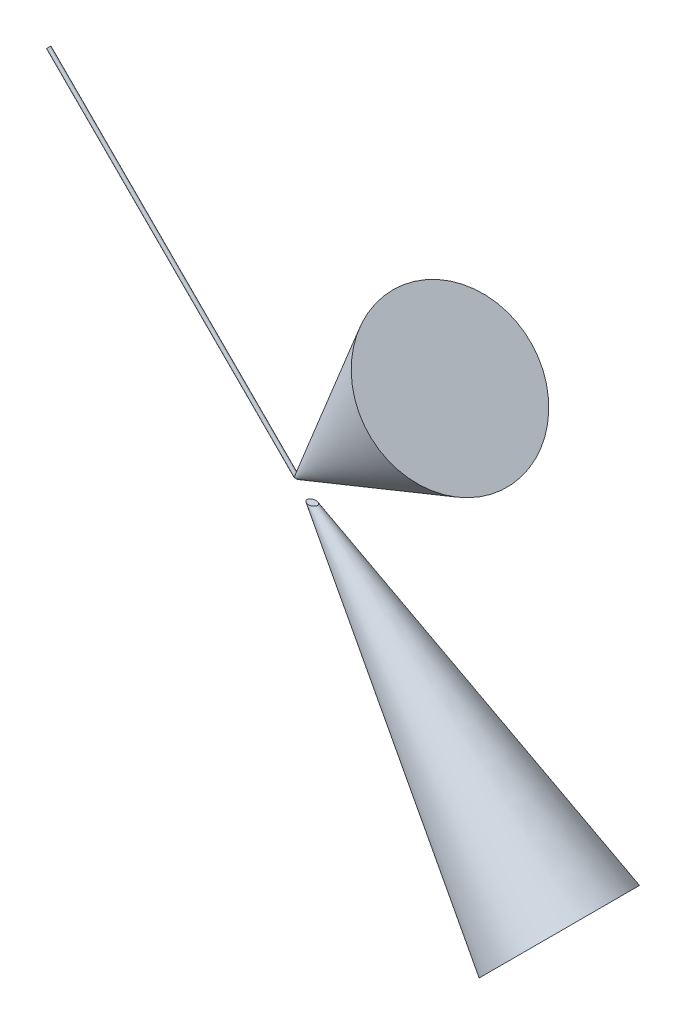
ISO-10303-21;
HEADER;
FILE_DESCRIPTION(('STEP AP214'),'2;1');
FILE_NAME('part.step','',(''),(''),'','','');
FILE_SCHEMA(('AUTOMOTIVE_DESIGN { 1 0 10303 214 1 1 1 1 }'));
ENDSEC;
DATA;
#1=APPLICATION_CONTEXT('core data for automotive mechanical design processes');
#2=APPLICATION_PROTOCOL_DEFINITION('international standard','automotive_design',2000,#1);
#3=PRODUCT_CONTEXT('',#1,'mechanical');
#4=PRODUCT('Part','Part','',(#3));
#5=PRODUCT_RELATED_PRODUCT_CATEGORY('part','',(#4));
#6=PRODUCT_DEFINITION_FORMATION('','',#4);
#7=PRODUCT_DEFINITION_CONTEXT('part definition',#1,'design');
#8=PRODUCT_DEFINITION('design','',#6,#7);
#9=PRODUCT_DEFINITION_SHAPE('','',#8);
#10=(LENGTH_UNIT() NAMED_UNIT(*) SI_UNIT(.MILLI.,.METRE.));
#11=(NAMED_UNIT(*) PLANE_ANGLE_UNIT() SI_UNIT($,.RADIAN.));
#12=(NAMED_UNIT(*) SI_UNIT($,.STERADIAN.) SOLID_ANGLE_UNIT());
#13=UNCERTAINTY_MEASURE_WITH_UNIT(LENGTH_MEASURE(1.E-05),#10,'distance_accuracy_value','');
#14=(GEOMETRIC_REPRESENTATION_CONTEXT(3) GLOBAL_UNCERTAINTY_ASSIGNED_CONTEXT((#13)) GLOBAL_UNIT_ASSIGNED_CONTEXT((#10,
#11,#12)) REPRESENTATION_CONTEXT('',''));
#15=CARTESIAN_POINT('',(0.,0.,0.));
#16=DIRECTION('',(0.,0.,1.));
#17=DIRECTION('',(1.,0.,0.));
#18=AXIS2_PLACEMENT_3D('',#15,#16,#17);
#19=CARTESIAN_POINT('',(-55.558556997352,55.5585569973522,0.));
#20=DIRECTION('',(-0.707106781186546,0.707106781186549,0.));
#21=DIRECTION('',(-0.707106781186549,-0.707106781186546,0.));
#22=AXIS2_PLACEMENT_3D('',#19,#20,#21);
#23=CYLINDRICAL_SURFACE('',#22,0.25);
#24=CARTESIAN_POINT('',(-35.3553390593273,35.3553390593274,0.));
#25=DIRECTION('',(-0.707106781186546,0.707106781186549,0.));
#26=DIRECTION('',(-0.707106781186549,-0.707106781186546,0.));
#27=AXIS2_PLACEMENT_3D('',#24,#25,#26);
#28=CIRCLE('',#27,0.25);
#29=CARTESIAN_POINT('',(-35.532115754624,35.1785623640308,0.));
#30=VERTEX_POINT('',#29);
#31=EDGE_CURVE('E46',#30,#30,#28,.T.);
#32=ORIENTED_EDGE('',*,*,#31,.F.);
#33=EDGE_LOOP('',(#32));
#34=FACE_BOUND('',#33,.T.);
#35=CARTESIAN_POINT('',(-0.999799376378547,0.999800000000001,-0.249999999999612));
#36=CARTESIAN_POINT('',(-1.00470901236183,1.00461675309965,-0.249992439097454));
#37=CARTESIAN_POINT('',(-1.00894423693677,1.00998662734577,-0.250001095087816));
#38=CARTESIAN_POINT('',(-1.01624272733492,1.02131728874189,-0.249980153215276));
#39=CARTESIAN_POINT('',(-1.01932991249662,1.0272623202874,-0.249951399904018));
#40=CARTESIAN_POINT('',(-1.02804242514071,1.04706337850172,-0.249691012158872));
#41=CARTESIAN_POINT('',(-1.03205564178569,1.06157119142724,-0.249251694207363));
#42=CARTESIAN_POINT('',(-1.0385569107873,1.09106946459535,-0.247372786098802));
#43=CARTESIAN_POINT('',(-1.04101149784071,1.10606368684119,-0.245912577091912));
#44=CARTESIAN_POINT('',(-1.04686474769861,1.14812805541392,-0.240116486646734));
#45=CARTESIAN_POINT('',(-1.04941995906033,1.17515125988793,-0.234409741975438));
#46=CARTESIAN_POINT('',(-1.05370587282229,1.22768941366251,-0.218453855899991));
#47=CARTESIAN_POINT('',(-1.05544333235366,1.25321514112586,-0.208243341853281));
#48=CARTESIAN_POINT('',(-1.0578000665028,1.29135435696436,-0.188058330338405));
#49=CARTESIAN_POINT('',(-1.05858172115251,1.30486909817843,-0.179804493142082));
#50=CARTESIAN_POINT('',(-1.0600090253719,1.33058367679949,-0.161409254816));
#51=CARTESIAN_POINT('',(-1.06065472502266,1.34278399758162,-0.151268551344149));
#52=CARTESIAN_POINT('',(-1.06168606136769,1.36284685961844,-0.131387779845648));
#53=CARTESIAN_POINT('',(-1.0620977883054,1.37107935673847,-0.122024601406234));
#54=CARTESIAN_POINT('',(-1.06282873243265,1.38594011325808,-0.102094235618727));
#55=CARTESIAN_POINT('',(-1.06314808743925,1.39257076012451,-0.0915288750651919));
#56=CARTESIAN_POINT('',(-1.06363197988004,1.40272397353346,-0.0714091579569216));
#57=CARTESIAN_POINT('',(-1.06381426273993,1.40659520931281,-0.062032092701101));
#58=CARTESIAN_POINT('',(-1.06410136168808,1.41272252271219,-0.0427608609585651));
#59=CARTESIAN_POINT('',(-1.06420623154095,1.41497972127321,-0.0328670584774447));
#60=CARTESIAN_POINT('',(-1.06433304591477,1.41771194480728,-0.0127915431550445));
#61=CARTESIAN_POINT('',(-1.06435465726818,1.41817980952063,-0.00260883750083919));
#62=CARTESIAN_POINT('',(-1.06431266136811,1.41727326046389,0.0176737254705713));
#63=CARTESIAN_POINT('',(-1.06424904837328,1.41589872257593,0.0277735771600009));
#64=CARTESIAN_POINT('',(-1.06404683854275,1.41155847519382,0.0469731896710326));
#65=CARTESIAN_POINT('',(-1.06391302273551,1.40869431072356,0.0560964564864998));
#66=CARTESIAN_POINT('',(-1.0635796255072,1.40162540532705,0.0738019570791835));
#67=CARTESIAN_POINT('',(-1.06338001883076,1.3974201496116,0.0823839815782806));
#68=CARTESIAN_POINT('',(-1.06283079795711,1.38599355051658,0.102154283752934));
#69=CARTESIAN_POINT('',(-1.06245307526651,1.37823701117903,0.113032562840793));
#70=CARTESIAN_POINT('',(-1.06159582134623,1.36107487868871,0.133393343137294));
#71=CARTESIAN_POINT('',(-1.06111608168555,1.35166591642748,0.142872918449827));
#72=CARTESIAN_POINT('',(-1.05984433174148,1.32751514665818,0.164072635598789));
#73=CARTESIAN_POINT('',(-1.05900512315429,1.31217402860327,0.175105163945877));
#74=CARTESIAN_POINT('',(-1.05711624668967,1.27997012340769,0.194626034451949));
#75=CARTESIAN_POINT('',(-1.0560661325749,1.26310415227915,0.203108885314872));
#76=CARTESIAN_POINT('',(-1.05320969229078,1.22124098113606,0.220791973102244));
#77=CARTESIAN_POINT('',(-1.05127017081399,1.19576257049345,0.228841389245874));
#78=CARTESIAN_POINT('',(-1.04748193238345,1.15698628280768,0.237869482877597));
#79=CARTESIAN_POINT('',(-1.04607202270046,1.14396291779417,0.240371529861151));
#80=CARTESIAN_POINT('',(-1.04274165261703,1.11783685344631,0.244435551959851));
#81=CARTESIAN_POINT('',(-1.04082168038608,1.10473424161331,0.245998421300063));
#82=CARTESIAN_POINT('',(-1.03671555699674,1.0825069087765,0.247952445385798));
#83=CARTESIAN_POINT('',(-1.03477707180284,1.0733545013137,0.248553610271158));
#84=CARTESIAN_POINT('',(-1.03006566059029,1.05524077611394,0.249410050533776));
#85=CARTESIAN_POINT('',(-1.02729389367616,1.04627921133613,0.249665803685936));
#86=CARTESIAN_POINT('',(-1.02145155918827,1.03179285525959,0.249905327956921));
#87=CARTESIAN_POINT('',(-1.01878375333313,1.02611254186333,0.249951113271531));
#88=CARTESIAN_POINT('',(-1.01255301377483,1.01527743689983,0.24999834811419));
#89=CARTESIAN_POINT('',(-1.00899481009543,1.01012006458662,0.250000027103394));
#90=CARTESIAN_POINT('',(-1.00331965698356,1.00344477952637,0.249999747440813));
#91=CARTESIAN_POINT('',(-1.00159972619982,1.00158264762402,0.249999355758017));
#92=CARTESIAN_POINT('',(-0.999799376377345,0.999800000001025,0.250000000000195));
#93=B_SPLINE_CURVE_WITH_KNOTS('',3,(#35,#36,#37,#38,#39,#40,#41,#42,#43,#44,#45,#46,#47,#48,#49,
#50,#51,#52,#53,#54,#55,#56,#57,#58,#59,#60,#61,#62,#63,#64,#65,#66,#67,#68,#69,#70,#71,#72,#73,
#74,#75,#76,#77,#78,#79,#80,#81,#82,#83,#84,#85,#86,#87,#88,#89,#90,#91,#92),.UNSPECIFIED.,.F.,
.F.,(4,2,2,2,2,2,2,2,2,2,2,2,2,2,2,2,2,2,2,2,2,2,2,2,2,2,2,2,4),(0.,0.0204460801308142,
0.040438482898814,0.0852704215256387,0.131035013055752,0.213834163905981,0.295936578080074,
0.343372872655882,0.390791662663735,0.428084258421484,0.465320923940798,0.495633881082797,
0.525925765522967,0.556338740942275,0.58675376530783,0.615324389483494,0.643905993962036,
0.683780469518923,0.723737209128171,0.780167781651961,0.836719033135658,0.916627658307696,
0.956610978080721,0.996556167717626,1.02465889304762,1.05272270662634,1.07149501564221,
1.09016964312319,1.09776723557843),.UNSPECIFIED.);
#94=CARTESIAN_POINT('',(-0.999999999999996,0.999999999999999,-0.25));
#95=VERTEX_POINT('',#94);
#96=CARTESIAN_POINT('',(-0.999999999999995,1.,0.25));
#97=VERTEX_POINT('',#96);
#98=EDGE_CURVE('E61',#95,#97,#93,.T.);
#99=ORIENTED_EDGE('',*,*,#98,.F.);
#100=CARTESIAN_POINT('',(-0.999999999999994,1.,0.));
#101=DIRECTION('',(0.,1.,0.));
#102=DIRECTION('',(-1.,0.,0.));
#103=AXIS2_PLACEMENT_3D('',#100,#101,#102);
#104=ELLIPSE('',#103,0.353553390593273,0.25);
#105=EDGE_CURVE('E12',#95,#97,#104,.T.);
#106=ORIENTED_EDGE('',*,*,#105,.T.);
#107=EDGE_LOOP('',(#99,#106));
#108=FACE_BOUND('',#107,.T.);
#109=ADVANCED_FACE('F42',(#34,#108),#23,.T.);
#110=CARTESIAN_POINT('',(-5.89657788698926,1.,-5.));
#111=DIRECTION('',(0.,1.,0.));
#112=DIRECTION('',(0.,0.,1.));
#113=AXIS2_PLACEMENT_3D('',#110,#111,#112);
#114=PLANE('',#113);
#115=ORIENTED_EDGE('',*,*,#105,.F.);
#116=CARTESIAN_POINT('',(-0.851666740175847,1.,0.));
#117=DIRECTION('',(0.,1.,0.));
#118=DIRECTION('',(1.,0.,0.));
#119=AXIS2_PLACEMENT_3D('',#116,#117,#118);
#120=ELLIPSE('',#119,0.407542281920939,0.268410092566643);
#121=EDGE_CURVE('E56',#97,#95,#120,.T.);
#122=ORIENTED_EDGE('',*,*,#121,.F.);
#123=EDGE_LOOP('',(#115,#122));
#124=FACE_BOUND('',#123,.T.);
#125=ADVANCED_FACE('F44',(#124),#114,.F.);
#126=CARTESIAN_POINT('',(-35.3553390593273,35.3553390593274,0.));
#127=DIRECTION('',(0.707106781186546,-0.707106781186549,0.));
#128=DIRECTION('',(0.707106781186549,0.707106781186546,0.));
#129=AXIS2_PLACEMENT_3D('',#126,#127,#128);
#130=PLANE('',#129);
#131=ORIENTED_EDGE('',*,*,#31,.T.);
#132=EDGE_LOOP('',(#131));
#133=FACE_BOUND('',#132,.T.);
#134=ADVANCED_FACE('F79',(#133),#130,.F.);
#135=CARTESIAN_POINT('',(-0.999999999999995,1.,0.));
#136=DIRECTION('',(0.707106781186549,0.707106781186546,0.));
#137=DIRECTION('',(-0.707106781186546,0.707106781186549,0.));
#138=AXIS2_PLACEMENT_3D('',#135,#136,#137);
#139=CONICAL_SURFACE('',#138,0.249999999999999,0.349065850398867);
#140=CARTESIAN_POINT('',(20.2132034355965,22.2132034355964,0.));
#141=DIRECTION('',(0.707106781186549,0.707106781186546,0.));
#142=DIRECTION('',(-0.707106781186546,0.707106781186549,0.));
#143=AXIS2_PLACEMENT_3D('',#140,#141,#142);
#144=CIRCLE('',#143,11.1691070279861);
#145=CARTESIAN_POINT('',(12.3154521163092,30.1109547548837,0.));
#146=VERTEX_POINT('',#145);
#147=EDGE_CURVE('E62',#146,#146,#144,.T.);
#148=ORIENTED_EDGE('',*,*,#147,.F.);
#149=EDGE_LOOP('',(#148));
#150=FACE_BOUND('',#149,.T.);
#151=ORIENTED_EDGE('',*,*,#98,.T.);
#152=ORIENTED_EDGE('',*,*,#121,.T.);
#153=EDGE_LOOP('',(#151,#152));
#154=FACE_BOUND('',#153,.T.);
#155=ADVANCED_FACE('F59',(#150,#154),#139,.T.);
#156=CARTESIAN_POINT('',(20.2132034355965,22.2132034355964,0.));
#157=DIRECTION('',(0.707106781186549,0.707106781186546,0.));
#158=DIRECTION('',(-0.707106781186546,0.707106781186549,0.));
#159=AXIS2_PLACEMENT_3D('',#156,#157,#158);
#160=PLANE('',#159);
#161=ORIENTED_EDGE('',*,*,#147,.T.);
#162=EDGE_LOOP('',(#161));
#163=FACE_BOUND('',#162,.T.);
#164=ADVANCED_FACE('F78',(#163),#160,.T.);
#165=CLOSED_SHELL('',(#109,#125,#134,#155,#164));
#166=MANIFOLD_SOLID_BREP('B2',#165);
#167=CARTESIAN_POINT('',(35.3553390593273,-35.3553390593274,-9.06634903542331));
#168=DIRECTION('',(-0.707106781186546,0.707106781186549,0.));
#169=DIRECTION('',(-0.707106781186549,-0.707106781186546,0.));
#170=AXIS2_PLACEMENT_3D('',#167,#168,#169);
#171=PLANE('',#170);
#172=CARTESIAN_POINT('',(35.3553390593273,-35.3553390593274,0.));
#173=DIRECTION('',(-0.707106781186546,0.707106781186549,0.));
#174=DIRECTION('',(-0.707106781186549,-0.707106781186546,0.));
#175=AXIS2_PLACEMENT_3D('',#172,#173,#174);
#176=CIRCLE('',#175,9.0663490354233);
#177=CARTESIAN_POINT('',(28.9444621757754,-41.7662159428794,0.));
#178=VERTEX_POINT('',#177);
#179=EDGE_CURVE('E41',#178,#178,#176,.T.);
#180=ORIENTED_EDGE('',*,*,#179,.F.);
#181=EDGE_LOOP('',(#180));
#182=FACE_BOUND('',#181,.T.);
#183=ADVANCED_FACE('F115',(#182),#171,.F.);
#184=CARTESIAN_POINT('',(35.3553390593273,-35.3553390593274,0.));
#185=DIRECTION('',(0.707106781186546,-0.707106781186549,0.));
#186=DIRECTION('',(0.707106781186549,0.707106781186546,0.));
#187=AXIS2_PLACEMENT_3D('',#184,#185,#186);
#188=CONICAL_SURFACE('',#187,9.0663490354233,0.174532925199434);
#189=CARTESIAN_POINT('',(1.12851922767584,-1.,0.));
#190=DIRECTION('',(0.,-1.,0.));
#191=DIRECTION('',(1.,0.,0.));
#192=AXIS2_PLACEMENT_3D('',#189,#190,#191);
#193=ELLIPSE('',#192,0.728868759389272,0.50731276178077);
#194=CARTESIAN_POINT('',(1.85738798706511,-1.,0.));
#195=VERTEX_POINT('',#194);
#196=EDGE_CURVE('E119',#195,#195,#193,.T.);
#197=ORIENTED_EDGE('',*,*,#196,.T.);
#198=EDGE_LOOP('',(#197));
#199=FACE_BOUND('',#198,.T.);
#200=ORIENTED_EDGE('',*,*,#179,.T.);
#201=EDGE_LOOP('',(#200));
#202=FACE_BOUND('',#201,.T.);
#203=ADVANCED_FACE('F117',(#199,#202),#188,.T.);
#204=CARTESIAN_POINT('',(-5.89657788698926,-1.,-5.));
#205=DIRECTION('',(0.,-1.,0.));
#206=DIRECTION('',(0.,0.,-1.));
#207=AXIS2_PLACEMENT_3D('',#204,#205,#206);
#208=PLANE('',#207);
#209=ORIENTED_EDGE('',*,*,#196,.F.);
#210=EDGE_LOOP('',(#209));
#211=FACE_BOUND('',#210,.T.);
#212=ADVANCED_FACE('F129',(#211),#208,.F.);
#213=CLOSED_SHELL('',(#183,#203,#212));
#214=MANIFOLD_SOLID_BREP('B6',#213);
#215=ADVANCED_BREP_SHAPE_REPRESENTATION('',(#18,#166,#214),#14);
#216=SHAPE_DEFINITION_REPRESENTATION(#9,#215);
ENDSEC;
END-ISO-10303-21;
